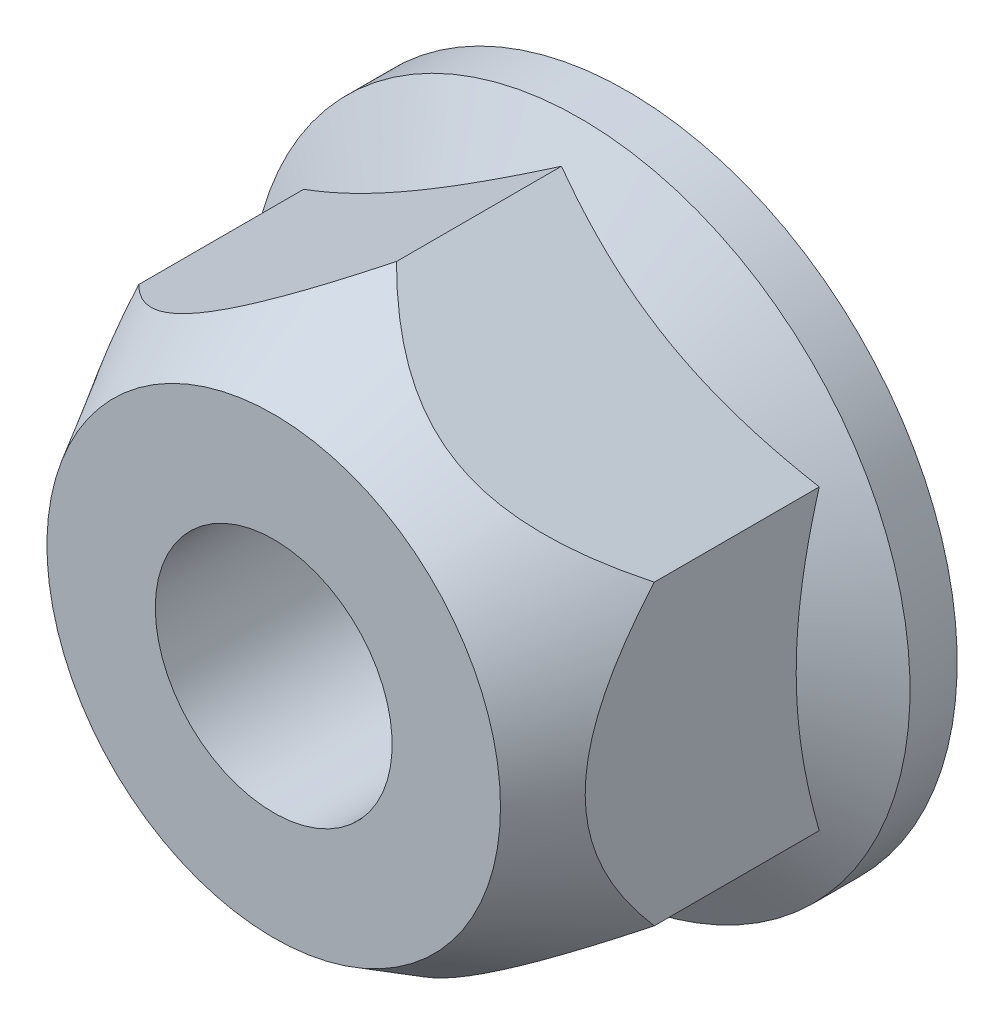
ISO-10303-21;
HEADER;
FILE_DESCRIPTION(('STEP AP214'),'2;1');
FILE_NAME('part.step','',(''),(''),'','','');
FILE_SCHEMA(('AUTOMOTIVE_DESIGN { 1 0 10303 214 1 1 1 1 }'));
ENDSEC;
DATA;
#1=APPLICATION_CONTEXT('core data for automotive mechanical design processes');
#2=APPLICATION_PROTOCOL_DEFINITION('international standard','automotive_design',2000,#1);
#3=PRODUCT_CONTEXT('',#1,'mechanical');
#4=PRODUCT('Part','Part','',(#3));
#5=PRODUCT_RELATED_PRODUCT_CATEGORY('part','',(#4));
#6=PRODUCT_DEFINITION_FORMATION('','',#4);
#7=PRODUCT_DEFINITION_CONTEXT('part definition',#1,'design');
#8=PRODUCT_DEFINITION('design','',#6,#7);
#9=PRODUCT_DEFINITION_SHAPE('','',#8);
#10=(LENGTH_UNIT() NAMED_UNIT(*) SI_UNIT(.MILLI.,.METRE.));
#11=(NAMED_UNIT(*) PLANE_ANGLE_UNIT() SI_UNIT($,.RADIAN.));
#12=(NAMED_UNIT(*) SI_UNIT($,.STERADIAN.) SOLID_ANGLE_UNIT());
#13=UNCERTAINTY_MEASURE_WITH_UNIT(LENGTH_MEASURE(1.E-05),#10,'distance_accuracy_value','');
#14=(GEOMETRIC_REPRESENTATION_CONTEXT(3) GLOBAL_UNCERTAINTY_ASSIGNED_CONTEXT((#13)) GLOBAL_UNIT_ASSIGNED_CONTEXT((#10,
#11,#12)) REPRESENTATION_CONTEXT('',''));
#15=CARTESIAN_POINT('',(0.,0.,0.));
#16=DIRECTION('',(0.,0.,1.));
#17=DIRECTION('',(1.,0.,0.));
#18=AXIS2_PLACEMENT_3D('',#15,#16,#17);
#19=CARTESIAN_POINT('',(0.,-6.41580486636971,24.5946241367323));
#20=DIRECTION('',(-0.5,0.866025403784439,0.));
#21=DIRECTION('',(-0.866025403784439,-0.5,0.));
#22=AXIS2_PLACEMENT_3D('',#19,#20,#21);
#23=PLANE('',#22);
#24=CARTESIAN_POINT('',(-0.000199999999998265,-6.41592033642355,4.97374844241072));
#25=CARTESIAN_POINT('',(0.0579139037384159,-6.38236825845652,5.03185952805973));
#26=CARTESIAN_POINT('',(0.11660767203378,-6.34848139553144,5.08919556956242));
#27=CARTESIAN_POINT('',(0.235282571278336,-6.27996441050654,5.20210150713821));
#28=CARTESIAN_POINT('',(0.295264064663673,-6.24533407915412,5.25767089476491));
#29=CARTESIAN_POINT('',(0.477899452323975,-6.13988948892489,5.42191134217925));
#30=CARTESIAN_POINT('',(0.602654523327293,-6.06786211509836,5.52751781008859));
#31=CARTESIAN_POINT('',(0.861876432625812,-5.91820027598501,5.73051382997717));
#32=CARTESIAN_POINT('',(0.99651091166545,-5.84046902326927,5.82762059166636));
#33=CARTESIAN_POINT('',(1.27307331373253,-5.68079564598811,6.00635658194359));
#34=CARTESIAN_POINT('',(1.41498420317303,-5.5988633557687,6.08802003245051));
#35=CARTESIAN_POINT('',(1.63990349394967,-5.46900614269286,6.19835812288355));
#36=CARTESIAN_POINT('',(1.72027897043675,-5.42260133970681,6.23421973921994));
#37=CARTESIAN_POINT('',(1.88313504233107,-5.32857634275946,6.29899176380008));
#38=CARTESIAN_POINT('',(1.96561579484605,-5.28095605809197,6.32790165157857));
#39=CARTESIAN_POINT('',(2.13169814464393,-5.18506836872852,6.3776650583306));
#40=CARTESIAN_POINT('',(2.2152856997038,-5.1368090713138,6.39858054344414));
#41=CARTESIAN_POINT('',(2.38371880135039,-5.0395641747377,6.43192134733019));
#42=CARTESIAN_POINT('',(2.46856410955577,-4.99057871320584,6.44434825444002));
#43=CARTESIAN_POINT('',(2.6396754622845,-4.89178752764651,6.46028925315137));
#44=CARTESIAN_POINT('',(2.72594739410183,-4.84197840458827,6.4637201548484));
#45=CARTESIAN_POINT('',(2.89839057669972,-4.74241828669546,6.46128042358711));
#46=CARTESIAN_POINT('',(2.98456182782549,-4.69266729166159,6.45540982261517));
#47=CARTESIAN_POINT('',(3.15626026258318,-4.5935371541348,6.43459655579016));
#48=CARTESIAN_POINT('',(3.24178563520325,-4.54415905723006,6.41963416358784));
#49=CARTESIAN_POINT('',(3.41142663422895,-4.44621678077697,6.38121396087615));
#50=CARTESIAN_POINT('',(3.49554137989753,-4.3976531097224,6.35775103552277));
#51=CARTESIAN_POINT('',(3.68587477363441,-4.28776407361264,6.29527408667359));
#52=CARTESIAN_POINT('',(3.79146933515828,-4.22679902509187,6.25372644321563));
#53=CARTESIAN_POINT('',(3.99901821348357,-4.10697062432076,6.15986281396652));
#54=CARTESIAN_POINT('',(4.10097023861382,-4.04810859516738,6.10754018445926));
#55=CARTESIAN_POINT('',(4.30148211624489,-3.93234300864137,5.99382365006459));
#56=CARTESIAN_POINT('',(4.40002661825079,-3.87544831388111,5.9323939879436));
#57=CARTESIAN_POINT('',(4.59340867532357,-3.76379913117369,5.80230485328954));
#58=CARTESIAN_POINT('',(4.68824683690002,-3.70904429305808,5.73364657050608));
#59=CARTESIAN_POINT('',(4.91790961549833,-3.57644842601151,5.5571180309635));
#60=CARTESIAN_POINT('',(5.05078966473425,-3.49973009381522,5.44587614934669));
#61=CARTESIAN_POINT('',(5.2446221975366,-3.38782082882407,5.27270411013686));
#62=CARTESIAN_POINT('',(5.30797541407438,-3.35124383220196,5.21427636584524));
#63=CARTESIAN_POINT('',(5.43324962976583,-3.27891673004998,5.09543609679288));
#64=CARTESIAN_POINT('',(5.49517092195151,-3.24316645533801,5.03502398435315));
#65=CARTESIAN_POINT('',(5.55645,-3.20778696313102,4.97374844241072));
#66=B_SPLINE_CURVE_WITH_KNOTS('',3,(#24,#25,#26,#27,#28,#29,#30,#31,#32,#33,#34,#35,#36,#37,#38,
#39,#40,#41,#42,#43,#44,#45,#46,#47,#48,#49,#50,#51,#52,#53,#54,#55,#56,#57,#58,#59,#60,#61,#62,
#63,#64,#65),.UNSPECIFIED.,.F.,.F.,(4,2,2,2,2,2,2,2,2,2,2,2,2,2,2,2,2,2,2,2,4),(0.,
0.266293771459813,0.532663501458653,1.06811595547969,1.61740258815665,2.1654573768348,
2.46372298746,2.76201092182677,3.05793747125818,3.35380863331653,3.65240634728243,
3.95100303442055,4.25024990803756,4.54967714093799,4.93548916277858,5.3215397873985,
5.70914841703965,6.09669335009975,6.66470266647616,6.94554888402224,7.22633711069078),.UNSPECIFIED.);
#67=CARTESIAN_POINT('',(0.,-6.41580486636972,4.97394844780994));
#68=VERTEX_POINT('',#67);
#69=CARTESIAN_POINT('',(5.55625,-3.20790243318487,4.97394844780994));
#70=VERTEX_POINT('',#69);
#71=EDGE_CURVE('E106',#68,#70,#66,.T.);
#72=ORIENTED_EDGE('',*,*,#71,.F.);
#73=DIRECTION('',(0.,0.,-1.));
#74=VECTOR('',#73,1.);
#75=CARTESIAN_POINT('',(0.,-6.41580486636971,24.5946241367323));
#76=LINE('',#75,#74);
#77=CARTESIAN_POINT('',(0.,-6.41580486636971,1.41794844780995));
#78=VERTEX_POINT('',#77);
#79=EDGE_CURVE('E121',#68,#78,#76,.T.);
#80=ORIENTED_EDGE('',*,*,#79,.T.);
#81=CARTESIAN_POINT('',(-0.000199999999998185,-6.41592033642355,1.41788177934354));
#82=CARTESIAN_POINT('',(0.121932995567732,-6.34540681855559,1.45858712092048));
#83=CARTESIAN_POINT('',(0.244521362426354,-6.27463039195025,1.49744514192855));
#84=CARTESIAN_POINT('',(0.490693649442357,-6.13250275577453,1.57095774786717));
#85=CARTESIAN_POINT('',(0.614277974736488,-6.06115131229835,1.60561051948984));
#86=CARTESIAN_POINT('',(0.987009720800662,-5.84595453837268,1.70258079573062));
#87=CARTESIAN_POINT('',(1.2376284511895,-5.70125974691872,1.75773662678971));
#88=CARTESIAN_POINT('',(1.61267482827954,-5.48472662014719,1.82241377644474));
#89=CARTESIAN_POINT('',(1.73598185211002,-5.41353527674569,1.84083851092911));
#90=CARTESIAN_POINT('',(1.98315307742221,-5.27083090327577,1.87173431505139));
#91=CARTESIAN_POINT('',(2.10701722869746,-5.19931790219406,1.88420591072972));
#92=CARTESIAN_POINT('',(2.35496067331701,-5.05616768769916,1.90287759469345));
#93=CARTESIAN_POINT('',(2.47903956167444,-4.98453070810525,1.90908480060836));
#94=CARTESIAN_POINT('',(2.72730512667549,-4.84119451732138,1.91510126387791));
#95=CARTESIAN_POINT('',(2.85149179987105,-4.76949530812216,1.91491071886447));
#96=CARTESIAN_POINT('',(3.1917275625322,-4.5730600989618,1.90559443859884));
#97=CARTESIAN_POINT('',(3.40766529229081,-4.44838839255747,1.88995302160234));
#98=CARTESIAN_POINT('',(3.83810650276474,-4.19987304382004,1.84035277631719));
#99=CARTESIAN_POINT('',(4.05260846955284,-4.07603027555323,1.80637699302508));
#100=CARTESIAN_POINT('',(4.48391602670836,-3.82701474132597,1.72144693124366));
#101=CARTESIAN_POINT('',(4.7006671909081,-3.70187339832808,1.67013279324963));
#102=CARTESIAN_POINT('',(5.13093704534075,-3.45345698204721,1.55367022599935));
#103=CARTESIAN_POINT('',(5.34446124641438,-3.33017872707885,1.48854915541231));
#104=CARTESIAN_POINT('',(5.55645,-3.20778696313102,1.41788177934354));
#105=B_SPLINE_CURVE_WITH_KNOTS('',3,(#81,#82,#83,#84,#85,#86,#87,#88,#89,#90,#91,#92,#93,#94,
#95,#96,#97,#98,#99,#100,#101,#102,#103,#104),.UNSPECIFIED.,.F.,.F.,(4,2,2,2,2,2,2,2,2,2,2,4),
(0.,0.44031690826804,0.880823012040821,1.76366572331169,2.19427472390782,2.62484566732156,
3.05492684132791,3.48499472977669,4.23370964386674,4.98311813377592,5.74914806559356,
6.51367405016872),.UNSPECIFIED.);
#106=CARTESIAN_POINT('',(5.55625,-3.20790243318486,1.41794844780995));
#107=VERTEX_POINT('',#106);
#108=EDGE_CURVE('E211',#78,#107,#105,.T.);
#109=ORIENTED_EDGE('',*,*,#108,.T.);
#110=DIRECTION('',(0.,0.,-1.));
#111=VECTOR('',#110,1.);
#112=CARTESIAN_POINT('',(5.55625,-3.20790243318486,24.5946241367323));
#113=LINE('',#112,#111);
#114=EDGE_CURVE('E73',#70,#107,#113,.T.);
#115=ORIENTED_EDGE('',*,*,#114,.F.);
#116=EDGE_LOOP('',(#72,#80,#109,#115));
#117=FACE_BOUND('',#116,.T.);
#118=ADVANCED_FACE('F43',(#117),#23,.F.);
#119=CARTESIAN_POINT('',(5.55625,-3.20790243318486,24.5946241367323));
#120=DIRECTION('',(-1.,0.,0.));
#121=DIRECTION('',(0.,-1.,0.));
#122=AXIS2_PLACEMENT_3D('',#119,#120,#121);
#123=PLANE('',#122);
#124=CARTESIAN_POINT('',(5.55625,-5.72144322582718,2.27266982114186));
#125=CARTESIAN_POINT('',(5.55625,-5.60257398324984,2.42033855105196));
#126=CARTESIAN_POINT('',(5.55625,-5.48263800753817,2.56716146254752));
#127=CARTESIAN_POINT('',(5.55625,-5.2402111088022,2.85874592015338));
#128=CARTESIAN_POINT('',(5.55625,-5.11771952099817,3.00350691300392));
#129=CARTESIAN_POINT('',(5.55625,-4.86865624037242,3.29186943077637));
#130=CARTESIAN_POINT('',(5.55625,-4.74205700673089,3.43544724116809));
#131=CARTESIAN_POINT('',(5.55625,-4.48538905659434,3.71945110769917));
#132=CARTESIAN_POINT('',(5.55625,-4.35532067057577,3.8598774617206));
#133=CARTESIAN_POINT('',(5.55625,-4.08219747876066,4.14614227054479));
#134=CARTESIAN_POINT('',(5.55625,-3.9388574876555,4.29170987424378));
#135=CARTESIAN_POINT('',(5.55625,-3.64652690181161,4.57717153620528));
#136=CARTESIAN_POINT('',(5.55625,-3.49753483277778,4.71706409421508));
#137=CARTESIAN_POINT('',(5.55625,-3.19338347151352,4.98878734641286));
#138=CARTESIAN_POINT('',(5.55625,-3.03825074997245,5.12064759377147));
#139=CARTESIAN_POINT('',(5.55625,-2.71999101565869,5.37426476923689));
#140=CARTESIAN_POINT('',(5.55625,-2.55686968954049,5.4960287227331));
#141=CARTESIAN_POINT('',(5.55625,-2.28053896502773,5.68507227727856));
#142=CARTESIAN_POINT('',(5.55625,-2.17009435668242,5.75638428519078));
#143=CARTESIAN_POINT('',(5.55625,-1.94482261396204,5.89187878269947));
#144=CARTESIAN_POINT('',(5.55625,-1.82999401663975,5.95605886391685));
#145=CARTESIAN_POINT('',(5.55625,-1.59692509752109,6.07498387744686));
#146=CARTESIAN_POINT('',(5.55625,-1.47872909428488,6.12981490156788));
#147=CARTESIAN_POINT('',(5.55625,-1.23795588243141,6.2288421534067));
#148=CARTESIAN_POINT('',(5.55625,-1.11538083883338,6.27304355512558));
#149=CARTESIAN_POINT('',(5.55625,-0.900499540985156,6.3383882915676));
#150=CARTESIAN_POINT('',(5.55625,-0.809103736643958,6.36253101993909));
#151=CARTESIAN_POINT('',(5.55625,-0.624676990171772,6.40340448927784));
#152=CARTESIAN_POINT('',(5.55625,-0.531646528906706,6.4201373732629));
#153=CARTESIAN_POINT('',(5.55625,-0.344515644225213,6.44561190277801));
#154=CARTESIAN_POINT('',(5.55625,-0.250415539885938,6.45435587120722));
#155=CARTESIAN_POINT('',(5.55625,-0.0618055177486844,6.46353090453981));
#156=CARTESIAN_POINT('',(5.55625,0.0327044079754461,6.46396180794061));
#157=CARTESIAN_POINT('',(5.55625,0.221385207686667,6.45648970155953));
#158=CARTESIAN_POINT('',(5.55625,0.315556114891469,6.44858753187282));
#159=CARTESIAN_POINT('',(5.55625,0.502890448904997,6.42476188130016));
#160=CARTESIAN_POINT('',(5.55625,0.596053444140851,6.40883509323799));
#161=CARTESIAN_POINT('',(5.55625,0.873190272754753,6.34978562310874));
#162=CARTESIAN_POINT('',(5.55625,1.05483672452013,6.29539262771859));
#163=CARTESIAN_POINT('',(5.55625,1.3705725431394,6.17707631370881));
#164=CARTESIAN_POINT('',(5.55625,1.50646996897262,6.11773793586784));
#165=CARTESIAN_POINT('',(5.55625,1.77257224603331,5.98729105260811));
#166=CARTESIAN_POINT('',(5.55625,1.90277320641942,5.91617465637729));
#167=CARTESIAN_POINT('',(5.55625,2.15901715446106,5.76386043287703));
#168=CARTESIAN_POINT('',(5.55625,2.28499860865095,5.68256026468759));
#169=CARTESIAN_POINT('',(5.55625,2.47006557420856,5.55507455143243));
#170=CARTESIAN_POINT('',(5.55625,2.53109262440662,5.51166538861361));
#171=CARTESIAN_POINT('',(5.55625,2.65193455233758,5.4231929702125));
#172=CARTESIAN_POINT('',(5.55625,2.7117494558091,5.37812974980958));
#173=CARTESIAN_POINT('',(5.55625,2.89799310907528,5.23416606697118));
#174=CARTESIAN_POINT('',(5.55625,3.02238528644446,5.13262423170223));
#175=CARTESIAN_POINT('',(5.55625,3.2666605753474,4.92423182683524));
#176=CARTESIAN_POINT('',(5.55625,3.38654238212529,4.81737974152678));
#177=CARTESIAN_POINT('',(5.55625,3.62250539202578,4.59934830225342));
#178=CARTESIAN_POINT('',(5.55625,3.73858282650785,4.48816488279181));
#179=CARTESIAN_POINT('',(5.55625,3.9673548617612,4.26236245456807));
#180=CARTESIAN_POINT('',(5.55625,4.08004911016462,4.14774309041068));
#181=CARTESIAN_POINT('',(5.55625,4.41498569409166,3.7984077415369));
#182=CARTESIAN_POINT('',(5.55625,4.63278809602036,3.55943449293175));
#183=CARTESIAN_POINT('',(5.55625,5.059308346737,3.0738232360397));
#184=CARTESIAN_POINT('',(5.55625,5.26803088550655,2.82718930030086));
#185=CARTESIAN_POINT('',(5.55625,5.65842897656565,2.35265460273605));
#186=CARTESIAN_POINT('',(5.55625,5.84075170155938,2.12528422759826));
#187=CARTESIAN_POINT('',(5.55625,6.20084949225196,1.66692475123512));
#188=CARTESIAN_POINT('',(5.55625,6.37862385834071,1.43593510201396));
#189=CARTESIAN_POINT('',(5.55625,6.72825503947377,0.974001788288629));
#190=CARTESIAN_POINT('',(5.55625,6.9001578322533,0.743092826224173));
#191=CARTESIAN_POINT('',(5.55625,7.24084911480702,0.279086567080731));
#192=CARTESIAN_POINT('',(5.55625,7.40963846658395,0.0459899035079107));
#193=CARTESIAN_POINT('',(5.55625,7.5771880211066,-0.187981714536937));
#194=B_SPLINE_CURVE_WITH_KNOTS('',3,(#124,#125,#126,#127,#128,#129,#130,#131,#132,#133,#134,
#135,#136,#137,#138,#139,#140,#141,#142,#143,#144,#145,#146,#147,#148,#149,#150,#151,#152,#153,
#154,#155,#156,#157,#158,#159,#160,#161,#162,#163,#164,#165,#166,#167,#168,#169,#170,#171,#172,
#173,#174,#175,#176,#177,#178,#179,#180,#181,#182,#183,#184,#185,#186,#187,#188,#189,#190,#191,
#192,#193),.UNSPECIFIED.,.F.,.F.,(4,2,2,2,2,2,2,2,2,2,2,2,2,2,2,2,2,2,2,2,2,2,2,2,2,2,2,2,2,2,2,
2,2,2,4),(0.,0.568713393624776,1.13757661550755,1.71179073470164,2.2859503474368,
2.89871059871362,3.51163179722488,4.12214151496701,4.73222278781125,5.12641066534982,
5.52073125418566,5.91119756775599,6.301473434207,6.58479622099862,6.86803701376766,
7.15119542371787,7.43435933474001,7.71749470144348,8.00074685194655,8.5671776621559,
9.0114544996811,9.45603019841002,9.90549885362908,10.1301490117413,10.3547943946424,
10.8363089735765,11.3179617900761,11.8000781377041,12.2822445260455,13.251905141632,
14.2210588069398,15.0953151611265,15.96970519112,16.8332904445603,17.6966328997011),.UNSPECIFIED.);
#195=CARTESIAN_POINT('',(5.55625,3.20790243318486,4.97394844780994));
#196=VERTEX_POINT('',#195);
#197=EDGE_CURVE('E99',#70,#196,#194,.T.);
#198=ORIENTED_EDGE('',*,*,#197,.F.);
#199=ORIENTED_EDGE('',*,*,#114,.T.);
#200=CARTESIAN_POINT('',(5.55625,-8.56370768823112,-0.771638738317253));
#201=CARTESIAN_POINT('',(5.55625,-8.3214728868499,-0.654347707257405));
#202=CARTESIAN_POINT('',(5.55625,-8.07867627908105,-0.53819678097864));
#203=CARTESIAN_POINT('',(5.55625,-7.59166048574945,-0.308817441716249));
#204=CARTESIAN_POINT('',(5.55625,-7.34744107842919,-0.195589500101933));
#205=CARTESIAN_POINT('',(5.55625,-6.85599671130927,0.0278826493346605));
#206=CARTESIAN_POINT('',(5.55625,-6.60876259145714,0.138106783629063));
#207=CARTESIAN_POINT('',(5.55625,-6.11230926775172,0.353972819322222));
#208=CARTESIAN_POINT('',(5.55625,-5.86309015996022,0.459614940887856));
#209=CARTESIAN_POINT('',(5.55625,-5.35442791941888,0.6683233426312));
#210=CARTESIAN_POINT('',(5.55625,-5.09490886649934,0.771205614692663));
#211=CARTESIAN_POINT('',(5.55625,-4.57281492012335,0.96905417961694));
#212=CARTESIAN_POINT('',(5.55625,-4.31023968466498,1.06401957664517));
#213=CARTESIAN_POINT('',(5.55625,-3.78212465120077,1.24350233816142));
#214=CARTESIAN_POINT('',(5.55625,-3.51659227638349,1.32804132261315));
#215=CARTESIAN_POINT('',(5.55625,-2.98171924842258,1.48392346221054));
#216=CARTESIAN_POINT('',(5.55625,-2.71237984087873,1.55527083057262));
#217=CARTESIAN_POINT('',(5.55625,-2.17122788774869,1.68093357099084));
#218=CARTESIAN_POINT('',(5.55625,-1.89943676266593,1.73533947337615));
#219=CARTESIAN_POINT('',(5.55625,-1.35253091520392,1.8240085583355));
#220=CARTESIAN_POINT('',(5.55625,-1.07741649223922,1.85827354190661));
#221=CARTESIAN_POINT('',(5.55625,-0.52880869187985,1.90347771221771));
#222=CARTESIAN_POINT('',(5.55625,-0.255340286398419,1.91471251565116));
#223=CARTESIAN_POINT('',(5.55625,0.291572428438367,1.91367874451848));
#224=CARTESIAN_POINT('',(5.55625,0.565016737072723,1.90140961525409));
#225=CARTESIAN_POINT('',(5.55625,1.03084261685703,1.86134810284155));
#226=CARTESIAN_POINT('',(5.55625,1.22372793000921,1.83909156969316));
#227=CARTESIAN_POINT('',(5.55625,1.6080429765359,1.78429826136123));
#228=CARTESIAN_POINT('',(5.55625,1.7994725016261,1.75176004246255));
#229=CARTESIAN_POINT('',(5.55625,2.37134756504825,1.64043774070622));
#230=CARTESIAN_POINT('',(5.55625,2.74915631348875,1.54796772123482));
#231=CARTESIAN_POINT('',(5.55625,3.31400044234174,1.38818156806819));
#232=CARTESIAN_POINT('',(5.55625,3.5039779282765,1.33067819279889));
#233=CARTESIAN_POINT('',(5.55625,3.88208651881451,1.20983855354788));
#234=CARTESIAN_POINT('',(5.55625,4.07021761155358,1.14650225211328));
#235=CARTESIAN_POINT('',(5.55625,4.44469564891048,1.01500145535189));
#236=CARTESIAN_POINT('',(5.55625,4.63104319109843,0.946838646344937));
#237=CARTESIAN_POINT('',(5.55625,5.00220395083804,0.806472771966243));
#238=CARTESIAN_POINT('',(5.55625,5.18701718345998,0.734269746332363));
#239=CARTESIAN_POINT('',(5.55625,5.61077877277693,0.564226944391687));
#240=CARTESIAN_POINT('',(5.55625,5.84925721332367,0.465218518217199));
#241=CARTESIAN_POINT('',(5.55625,6.32428340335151,0.262661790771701));
#242=CARTESIAN_POINT('',(5.55625,6.56083105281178,0.159113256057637));
#243=CARTESIAN_POINT('',(5.55625,7.032335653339,-0.0516451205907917));
#244=CARTESIAN_POINT('',(5.55625,7.26729231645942,-0.15885560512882));
#245=CARTESIAN_POINT('',(5.55625,7.73583378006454,-0.376237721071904));
#246=CARTESIAN_POINT('',(5.55625,7.96941855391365,-0.48640940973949));
#247=CARTESIAN_POINT('',(5.55625,8.66886363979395,-0.820732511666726));
#248=CARTESIAN_POINT('',(5.55625,9.13299392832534,-1.04850140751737));
#249=CARTESIAN_POINT('',(5.55625,10.057949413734,-1.51065284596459));
#250=CARTESIAN_POINT('',(5.55625,10.5187744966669,-1.74503561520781));
#251=CARTESIAN_POINT('',(5.55625,11.1898981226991,-2.09075989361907));
#252=CARTESIAN_POINT('',(5.55625,11.4011640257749,-2.20022904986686));
#253=CARTESIAN_POINT('',(5.55625,11.8232347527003,-2.42004379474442));
#254=CARTESIAN_POINT('',(5.55625,12.0340395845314,-2.53038936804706));
#255=CARTESIAN_POINT('',(5.55625,12.6658701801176,-2.86257508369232));
#256=CARTESIAN_POINT('',(5.55625,13.0862962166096,-3.08555604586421));
#257=CARTESIAN_POINT('',(5.55625,13.9249423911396,-3.53333589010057));
#258=CARTESIAN_POINT('',(5.55625,14.3431653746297,-3.75812945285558));
#259=CARTESIAN_POINT('',(5.55625,15.1785900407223,-4.20955673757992));
#260=CARTESIAN_POINT('',(5.55625,15.5957917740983,-4.43619036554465));
#261=CARTESIAN_POINT('',(5.55625,16.0126138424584,-4.66351578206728));
#262=B_SPLINE_CURVE_WITH_KNOTS('',3,(#200,#201,#202,#203,#204,#205,#206,#207,#208,#209,#210,
#211,#212,#213,#214,#215,#216,#217,#218,#219,#220,#221,#222,#223,#224,#225,#226,#227,#228,#229,
#230,#231,#232,#233,#234,#235,#236,#237,#238,#239,#240,#241,#242,#243,#244,#245,#246,#247,#248,
#249,#250,#251,#252,#253,#254,#255,#256,#257,#258,#259,#260,#261),.UNSPECIFIED.,.F.,.F.,(4,2,2,
2,2,2,2,2,2,2,2,2,2,2,2,2,2,2,2,2,2,2,2,2,2,2,2,2,2,2,4),(0.,0.807422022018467,1.61497344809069,
2.42701175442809,3.23901099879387,4.07641589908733,4.91391542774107,5.74964804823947,
6.58511328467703,7.41603422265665,8.24688084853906,9.06699415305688,9.88712681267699,
10.4693386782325,11.0516323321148,12.2168895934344,12.812309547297,13.4077333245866,
14.0029500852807,14.5981609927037,15.3727419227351,16.1473627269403,16.9221201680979,
17.696892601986,19.2478229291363,20.7988064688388,21.5126332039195,22.2264474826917,
23.6541294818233,25.0785486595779,26.5028955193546),.UNSPECIFIED.);
#263=CARTESIAN_POINT('',(5.55625,3.20790243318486,1.41794844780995));
#264=VERTEX_POINT('',#263);
#265=EDGE_CURVE('E118',#107,#264,#262,.T.);
#266=ORIENTED_EDGE('',*,*,#265,.T.);
#267=DIRECTION('',(0.,0.,-1.));
#268=VECTOR('',#267,1.);
#269=CARTESIAN_POINT('',(5.55625,3.20790243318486,24.5946241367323));
#270=LINE('',#269,#268);
#271=EDGE_CURVE('E113',#196,#264,#270,.T.);
#272=ORIENTED_EDGE('',*,*,#271,.F.);
#273=EDGE_LOOP('',(#198,#199,#266,#272));
#274=FACE_BOUND('',#273,.T.);
#275=ADVANCED_FACE('F120',(#274),#123,.F.);
#276=CARTESIAN_POINT('',(5.55625,3.20790243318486,24.5946241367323));
#277=DIRECTION('',(-0.5,-0.866025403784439,0.));
#278=DIRECTION('',(0.866025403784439,-0.5,0.));
#279=AXIS2_PLACEMENT_3D('',#276,#277,#278);
#280=PLANE('',#279);
#281=CARTESIAN_POINT('',(5.55645,3.20778696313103,4.97374844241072));
#282=CARTESIAN_POINT('',(5.49833609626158,3.24133904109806,5.03185952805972));
#283=CARTESIAN_POINT('',(5.43964232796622,3.27522590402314,5.08919556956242));
#284=CARTESIAN_POINT('',(5.32096742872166,3.34374288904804,5.20210150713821));
#285=CARTESIAN_POINT('',(5.26098593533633,3.37837322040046,5.25767089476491));
#286=CARTESIAN_POINT('',(5.07835054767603,3.48381781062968,5.42191134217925));
#287=CARTESIAN_POINT('',(4.95359547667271,3.55584518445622,5.52751781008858));
#288=CARTESIAN_POINT('',(4.69437356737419,3.70550702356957,5.73051382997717));
#289=CARTESIAN_POINT('',(4.55973908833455,3.78323827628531,5.82762059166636));
#290=CARTESIAN_POINT('',(4.28317668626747,3.94291165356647,6.00635658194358));
#291=CARTESIAN_POINT('',(4.14126579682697,4.02484394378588,6.08802003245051));
#292=CARTESIAN_POINT('',(3.91634650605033,4.15470115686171,6.19835812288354));
#293=CARTESIAN_POINT('',(3.83597102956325,4.20110595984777,6.23421973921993));
#294=CARTESIAN_POINT('',(3.67311495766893,4.29513095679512,6.29899176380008));
#295=CARTESIAN_POINT('',(3.59063420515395,4.34275124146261,6.32790165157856));
#296=CARTESIAN_POINT('',(3.42455185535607,4.43863893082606,6.3776650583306));
#297=CARTESIAN_POINT('',(3.3409643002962,4.48689822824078,6.39858054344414));
#298=CARTESIAN_POINT('',(3.17253119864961,4.58414312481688,6.43192134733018));
#299=CARTESIAN_POINT('',(3.08768589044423,4.63312858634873,6.44434825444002));
#300=CARTESIAN_POINT('',(2.9165745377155,4.73191977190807,6.46028925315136));
#301=CARTESIAN_POINT('',(2.83030260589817,4.78172889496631,6.4637201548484));
#302=CARTESIAN_POINT('',(2.65785942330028,4.88128901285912,6.46128042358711));
#303=CARTESIAN_POINT('',(2.57168817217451,4.93104000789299,6.45540982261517));
#304=CARTESIAN_POINT('',(2.39998973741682,5.03017014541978,6.43459655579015));
#305=CARTESIAN_POINT('',(2.31446436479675,5.07954824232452,6.41963416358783));
#306=CARTESIAN_POINT('',(2.14482336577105,5.17749051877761,6.38121396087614));
#307=CARTESIAN_POINT('',(2.06070862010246,5.22605418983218,6.35775103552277));
#308=CARTESIAN_POINT('',(1.87037522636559,5.33594322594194,6.29527408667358));
#309=CARTESIAN_POINT('',(1.76478066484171,5.39690827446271,6.25372644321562));
#310=CARTESIAN_POINT('',(1.55723178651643,5.51673667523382,6.15986281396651));
#311=CARTESIAN_POINT('',(1.45527976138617,5.5755987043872,6.10754018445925));
#312=CARTESIAN_POINT('',(1.2547678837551,5.69136429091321,5.99382365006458));
#313=CARTESIAN_POINT('',(1.15622338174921,5.74825898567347,5.93239398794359));
#314=CARTESIAN_POINT('',(0.962841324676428,5.85990816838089,5.80230485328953));
#315=CARTESIAN_POINT('',(0.868003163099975,5.9146630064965,5.73364657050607));
#316=CARTESIAN_POINT('',(0.638340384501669,6.04725887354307,5.55711803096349));
#317=CARTESIAN_POINT('',(0.505460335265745,6.12397720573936,5.44587614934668));
#318=CARTESIAN_POINT('',(0.311627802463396,6.23588647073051,5.27270411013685));
#319=CARTESIAN_POINT('',(0.248274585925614,6.27246346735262,5.21427636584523));
#320=CARTESIAN_POINT('',(0.123000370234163,6.3447905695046,5.09543609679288));
#321=CARTESIAN_POINT('',(0.0610790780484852,6.38054084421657,5.03502398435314));
#322=CARTESIAN_POINT('',(-0.000200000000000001,6.41592033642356,4.97374844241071));
#323=B_SPLINE_CURVE_WITH_KNOTS('',3,(#281,#282,#283,#284,#285,#286,#287,#288,#289,#290,#291,
#292,#293,#294,#295,#296,#297,#298,#299,#300,#301,#302,#303,#304,#305,#306,#307,#308,#309,#310,
#311,#312,#313,#314,#315,#316,#317,#318,#319,#320,#321,#322),.UNSPECIFIED.,.F.,.F.,(4,2,2,2,2,2,
2,2,2,2,2,2,2,2,2,2,2,2,2,2,4),(0.,0.266293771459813,0.532663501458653,1.0681159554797,
1.61740258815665,2.16545737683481,2.46372298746,2.76201092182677,3.05793747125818,
3.35380863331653,3.65240634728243,3.95100303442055,4.25024990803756,4.54967714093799,
4.93548916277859,5.32153978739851,5.70914841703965,6.09669335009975,6.66470266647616,
6.94554888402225,7.22633711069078),.UNSPECIFIED.);
#324=CARTESIAN_POINT('',(0.,6.41580486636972,4.97394844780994));
#325=VERTEX_POINT('',#324);
#326=EDGE_CURVE('E101',#196,#325,#323,.T.);
#327=ORIENTED_EDGE('',*,*,#326,.F.);
#328=ORIENTED_EDGE('',*,*,#271,.T.);
#329=CARTESIAN_POINT('',(5.55645,3.20778696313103,1.41788177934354));
#330=CARTESIAN_POINT('',(5.43431700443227,3.27830048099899,1.45858712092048));
#331=CARTESIAN_POINT('',(5.31172863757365,3.34907690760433,1.49744514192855));
#332=CARTESIAN_POINT('',(5.06555635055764,3.49120454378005,1.57095774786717));
#333=CARTESIAN_POINT('',(4.94197202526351,3.56255598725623,1.60561051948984));
#334=CARTESIAN_POINT('',(4.56924027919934,3.7777527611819,1.70258079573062));
#335=CARTESIAN_POINT('',(4.3186215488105,3.92244755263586,1.75773662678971));
#336=CARTESIAN_POINT('',(3.94357517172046,4.13898067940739,1.82241377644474));
#337=CARTESIAN_POINT('',(3.82026814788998,4.21017202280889,1.84083851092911));
#338=CARTESIAN_POINT('',(3.57309692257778,4.35287639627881,1.87173431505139));
#339=CARTESIAN_POINT('',(3.44923277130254,4.42438939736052,1.88420591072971));
#340=CARTESIAN_POINT('',(3.20128932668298,4.56753961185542,1.90287759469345));
#341=CARTESIAN_POINT('',(3.07721043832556,4.63917659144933,1.90908480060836));
#342=CARTESIAN_POINT('',(2.82894487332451,4.7825127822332,1.91510126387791));
#343=CARTESIAN_POINT('',(2.70475820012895,4.85421199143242,1.91491071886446));
#344=CARTESIAN_POINT('',(2.36452243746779,5.05064720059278,1.90559443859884));
#345=CARTESIAN_POINT('',(2.14858470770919,5.1753189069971,1.88995302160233));
#346=CARTESIAN_POINT('',(1.71814349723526,5.42383425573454,1.84035277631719));
#347=CARTESIAN_POINT('',(1.50364153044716,5.54767702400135,1.80637699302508));
#348=CARTESIAN_POINT('',(1.07233397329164,5.79669255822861,1.72144693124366));
#349=CARTESIAN_POINT('',(0.855582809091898,5.9218339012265,1.67013279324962));
#350=CARTESIAN_POINT('',(0.425312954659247,6.17025031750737,1.55367022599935));
#351=CARTESIAN_POINT('',(0.211788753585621,6.29352857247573,1.48854915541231));
#352=CARTESIAN_POINT('',(-0.000200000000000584,6.41592033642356,1.41788177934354));
#353=B_SPLINE_CURVE_WITH_KNOTS('',3,(#329,#330,#331,#332,#333,#334,#335,#336,#337,#338,#339,
#340,#341,#342,#343,#344,#345,#346,#347,#348,#349,#350,#351,#352),.UNSPECIFIED.,.F.,.F.,(4,2,2,
2,2,2,2,2,2,2,2,4),(0.,0.44031690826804,0.880823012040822,1.76366572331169,2.19427472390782,
2.62484566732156,3.05492684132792,3.48499472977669,4.23370964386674,4.98311813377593,
5.74914806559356,6.51367405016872),.UNSPECIFIED.);
#354=CARTESIAN_POINT('',(0.,6.41580486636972,1.41794844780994));
#355=VERTEX_POINT('',#354);
#356=EDGE_CURVE('E194',#264,#355,#353,.T.);
#357=ORIENTED_EDGE('',*,*,#356,.T.);
#358=DIRECTION('',(0.,0.,-1.));
#359=VECTOR('',#358,1.);
#360=CARTESIAN_POINT('',(0.,6.41580486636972,24.5946241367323));
#361=LINE('',#360,#359);
#362=EDGE_CURVE('E112',#325,#355,#361,.T.);
#363=ORIENTED_EDGE('',*,*,#362,.F.);
#364=EDGE_LOOP('',(#327,#328,#357,#363));
#365=FACE_BOUND('',#364,.T.);
#366=ADVANCED_FACE('F111',(#365),#280,.F.);
#367=CARTESIAN_POINT('',(0.,6.41580486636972,24.5946241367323));
#368=DIRECTION('',(0.5,-0.866025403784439,0.));
#369=DIRECTION('',(0.866025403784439,0.5,0.));
#370=AXIS2_PLACEMENT_3D('',#367,#368,#369);
#371=PLANE('',#370);
#372=CARTESIAN_POINT('',(0.000199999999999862,6.41592033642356,4.97374844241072));
#373=CARTESIAN_POINT('',(-0.0579139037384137,6.38236825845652,5.03185952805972));
#374=CARTESIAN_POINT('',(-0.116607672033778,6.34848139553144,5.08919556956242));
#375=CARTESIAN_POINT('',(-0.235282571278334,6.27996441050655,5.20210150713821));
#376=CARTESIAN_POINT('',(-0.295264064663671,6.24533407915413,5.25767089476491));
#377=CARTESIAN_POINT('',(-0.477899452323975,6.1398894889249,5.42191134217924));
#378=CARTESIAN_POINT('',(-0.602654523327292,6.06786211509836,5.52751781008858));
#379=CARTESIAN_POINT('',(-0.861876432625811,5.91820027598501,5.73051382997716));
#380=CARTESIAN_POINT('',(-0.996510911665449,5.84046902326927,5.82762059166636));
#381=CARTESIAN_POINT('',(-1.27307331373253,5.68079564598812,6.00635658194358));
#382=CARTESIAN_POINT('',(-1.41498420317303,5.5988633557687,6.08802003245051));
#383=CARTESIAN_POINT('',(-1.63990349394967,5.46900614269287,6.19835812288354));
#384=CARTESIAN_POINT('',(-1.72027897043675,5.42260133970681,6.23421973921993));
#385=CARTESIAN_POINT('',(-1.88313504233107,5.32857634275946,6.29899176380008));
#386=CARTESIAN_POINT('',(-1.96561579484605,5.28095605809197,6.32790165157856));
#387=CARTESIAN_POINT('',(-2.13169814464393,5.18506836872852,6.3776650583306));
#388=CARTESIAN_POINT('',(-2.2152856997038,5.1368090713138,6.39858054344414));
#389=CARTESIAN_POINT('',(-2.38371880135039,5.0395641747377,6.43192134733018));
#390=CARTESIAN_POINT('',(-2.46856410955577,4.99057871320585,6.44434825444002));
#391=CARTESIAN_POINT('',(-2.6396754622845,4.89178752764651,6.46028925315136));
#392=CARTESIAN_POINT('',(-2.72594739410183,4.84197840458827,6.4637201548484));
#393=CARTESIAN_POINT('',(-2.89839057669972,4.74241828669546,6.46128042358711));
#394=CARTESIAN_POINT('',(-2.98456182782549,4.69266729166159,6.45540982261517));
#395=CARTESIAN_POINT('',(-3.15626026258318,4.5935371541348,6.43459655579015));
#396=CARTESIAN_POINT('',(-3.24178563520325,4.54415905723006,6.41963416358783));
#397=CARTESIAN_POINT('',(-3.41142663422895,4.44621678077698,6.38121396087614));
#398=CARTESIAN_POINT('',(-3.49554137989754,4.3976531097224,6.35775103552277));
#399=CARTESIAN_POINT('',(-3.68587477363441,4.28776407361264,6.29527408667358));
#400=CARTESIAN_POINT('',(-3.79146933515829,4.22679902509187,6.25372644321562));
#401=CARTESIAN_POINT('',(-3.99901821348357,4.10697062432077,6.15986281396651));
#402=CARTESIAN_POINT('',(-4.10097023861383,4.04810859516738,6.10754018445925));
#403=CARTESIAN_POINT('',(-4.30148211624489,3.93234300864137,5.99382365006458));
#404=CARTESIAN_POINT('',(-4.40002661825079,3.87544831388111,5.93239398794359));
#405=CARTESIAN_POINT('',(-4.59340867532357,3.7637991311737,5.80230485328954));
#406=CARTESIAN_POINT('',(-4.68824683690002,3.70904429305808,5.73364657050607));
#407=CARTESIAN_POINT('',(-4.91790961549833,3.57644842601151,5.55711803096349));
#408=CARTESIAN_POINT('',(-5.05078966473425,3.49973009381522,5.44587614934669));
#409=CARTESIAN_POINT('',(-5.2446221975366,3.38782082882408,5.27270411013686));
#410=CARTESIAN_POINT('',(-5.30797541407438,3.35124383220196,5.21427636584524));
#411=CARTESIAN_POINT('',(-5.43324962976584,3.27891673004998,5.09543609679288));
#412=CARTESIAN_POINT('',(-5.49517092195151,3.24316645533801,5.03502398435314));
#413=CARTESIAN_POINT('',(-5.55645,3.20778696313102,4.97374844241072));
#414=B_SPLINE_CURVE_WITH_KNOTS('',3,(#372,#373,#374,#375,#376,#377,#378,#379,#380,#381,#382,
#383,#384,#385,#386,#387,#388,#389,#390,#391,#392,#393,#394,#395,#396,#397,#398,#399,#400,#401,
#402,#403,#404,#405,#406,#407,#408,#409,#410,#411,#412,#413),.UNSPECIFIED.,.F.,.F.,(4,2,2,2,2,2,
2,2,2,2,2,2,2,2,2,2,2,2,2,2,4),(0.,0.266293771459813,0.532663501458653,1.06811595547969,
1.61740258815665,2.16545737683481,2.46372298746,2.76201092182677,3.05793747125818,
3.35380863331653,3.65240634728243,3.95100303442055,4.25024990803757,4.54967714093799,
4.93548916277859,5.32153978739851,5.70914841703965,6.09669335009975,6.66470266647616,
6.94554888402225,7.22633711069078),.UNSPECIFIED.);
#415=CARTESIAN_POINT('',(-5.55625,3.20790243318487,4.97394844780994));
#416=VERTEX_POINT('',#415);
#417=EDGE_CURVE('E114',#325,#416,#414,.T.);
#418=ORIENTED_EDGE('',*,*,#417,.F.);
#419=ORIENTED_EDGE('',*,*,#362,.T.);
#420=CARTESIAN_POINT('',(0.000199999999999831,6.41592033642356,1.41788177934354));
#421=CARTESIAN_POINT('',(-0.121932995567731,6.34540681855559,1.45858712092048));
#422=CARTESIAN_POINT('',(-0.244521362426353,6.27463039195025,1.49744514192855));
#423=CARTESIAN_POINT('',(-0.490693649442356,6.13250275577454,1.57095774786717));
#424=CARTESIAN_POINT('',(-0.614277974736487,6.06115131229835,1.60561051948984));
#425=CARTESIAN_POINT('',(-0.987009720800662,5.84595453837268,1.70258079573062));
#426=CARTESIAN_POINT('',(-1.2376284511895,5.70125974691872,1.75773662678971));
#427=CARTESIAN_POINT('',(-1.61267482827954,5.48472662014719,1.82241377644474));
#428=CARTESIAN_POINT('',(-1.73598185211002,5.41353527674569,1.84083851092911));
#429=CARTESIAN_POINT('',(-1.98315307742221,5.27083090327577,1.87173431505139));
#430=CARTESIAN_POINT('',(-2.10701722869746,5.19931790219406,1.88420591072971));
#431=CARTESIAN_POINT('',(-2.35496067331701,5.05616768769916,1.90287759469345));
#432=CARTESIAN_POINT('',(-2.47903956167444,4.98453070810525,1.90908480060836));
#433=CARTESIAN_POINT('',(-2.72730512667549,4.84119451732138,1.91510126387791));
#434=CARTESIAN_POINT('',(-2.85149179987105,4.76949530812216,1.91491071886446));
#435=CARTESIAN_POINT('',(-3.1917275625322,4.5730600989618,1.90559443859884));
#436=CARTESIAN_POINT('',(-3.40766529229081,4.44838839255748,1.88995302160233));
#437=CARTESIAN_POINT('',(-3.83810650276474,4.19987304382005,1.84035277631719));
#438=CARTESIAN_POINT('',(-4.05260846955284,4.07603027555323,1.80637699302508));
#439=CARTESIAN_POINT('',(-4.48391602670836,3.82701474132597,1.72144693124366));
#440=CARTESIAN_POINT('',(-4.7006671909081,3.70187339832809,1.67013279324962));
#441=CARTESIAN_POINT('',(-5.13093704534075,3.45345698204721,1.55367022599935));
#442=CARTESIAN_POINT('',(-5.34446124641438,3.33017872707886,1.48854915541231));
#443=CARTESIAN_POINT('',(-5.55645,3.20778696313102,1.41788177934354));
#444=B_SPLINE_CURVE_WITH_KNOTS('',3,(#420,#421,#422,#423,#424,#425,#426,#427,#428,#429,#430,
#431,#432,#433,#434,#435,#436,#437,#438,#439,#440,#441,#442,#443),.UNSPECIFIED.,.F.,.F.,(4,2,2,
2,2,2,2,2,2,2,2,4),(0.,0.440316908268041,0.880823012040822,1.76366572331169,2.19427472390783,
2.62484566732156,3.05492684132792,3.48499472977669,4.23370964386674,4.98311813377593,
5.74914806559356,6.51367405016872),.UNSPECIFIED.);
#445=CARTESIAN_POINT('',(-5.55625,3.20790243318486,1.41794844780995));
#446=VERTEX_POINT('',#445);
#447=EDGE_CURVE('E203',#355,#446,#444,.T.);
#448=ORIENTED_EDGE('',*,*,#447,.T.);
#449=DIRECTION('',(0.,0.,-1.));
#450=VECTOR('',#449,1.);
#451=CARTESIAN_POINT('',(-5.55625,3.20790243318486,24.5946241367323));
#452=LINE('',#451,#450);
#453=EDGE_CURVE('E125',#416,#446,#452,.T.);
#454=ORIENTED_EDGE('',*,*,#453,.F.);
#455=EDGE_LOOP('',(#418,#419,#448,#454));
#456=FACE_BOUND('',#455,.T.);
#457=ADVANCED_FACE('F162',(#456),#371,.F.);
#458=CARTESIAN_POINT('',(-5.55625,3.20790243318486,24.5946241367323));
#459=DIRECTION('',(1.,0.,0.));
#460=DIRECTION('',(0.,0.,-1.));
#461=AXIS2_PLACEMENT_3D('',#458,#459,#460);
#462=PLANE('',#461);
#463=CARTESIAN_POINT('',(-5.55625,-5.72144322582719,2.27266982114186));
#464=CARTESIAN_POINT('',(-5.55625,-5.60257398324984,2.42033855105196));
#465=CARTESIAN_POINT('',(-5.55625,-5.48263800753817,2.56716146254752));
#466=CARTESIAN_POINT('',(-5.55625,-5.2402111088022,2.85874592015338));
#467=CARTESIAN_POINT('',(-5.55625,-5.11771952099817,3.00350691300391));
#468=CARTESIAN_POINT('',(-5.55625,-4.86865624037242,3.29186943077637));
#469=CARTESIAN_POINT('',(-5.55625,-4.74205700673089,3.43544724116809));
#470=CARTESIAN_POINT('',(-5.55625,-4.48538905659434,3.71945110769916));
#471=CARTESIAN_POINT('',(-5.55625,-4.35532067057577,3.8598774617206));
#472=CARTESIAN_POINT('',(-5.55625,-4.08219747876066,4.14614227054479));
#473=CARTESIAN_POINT('',(-5.55625,-3.9388574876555,4.29170987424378));
#474=CARTESIAN_POINT('',(-5.55625,-3.6465269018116,4.57717153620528));
#475=CARTESIAN_POINT('',(-5.55625,-3.49753483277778,4.71706409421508));
#476=CARTESIAN_POINT('',(-5.55625,-3.19338347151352,4.98878734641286));
#477=CARTESIAN_POINT('',(-5.55625,-3.03825074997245,5.12064759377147));
#478=CARTESIAN_POINT('',(-5.55625,-2.71999101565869,5.37426476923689));
#479=CARTESIAN_POINT('',(-5.55625,-2.55686968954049,5.4960287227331));
#480=CARTESIAN_POINT('',(-5.55625,-2.28053896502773,5.68507227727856));
#481=CARTESIAN_POINT('',(-5.55625,-2.17009435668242,5.75638428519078));
#482=CARTESIAN_POINT('',(-5.55625,-1.94482261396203,5.89187878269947));
#483=CARTESIAN_POINT('',(-5.55625,-1.82999401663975,5.95605886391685));
#484=CARTESIAN_POINT('',(-5.55625,-1.59692509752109,6.07498387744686));
#485=CARTESIAN_POINT('',(-5.55625,-1.47872909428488,6.12981490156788));
#486=CARTESIAN_POINT('',(-5.55625,-1.23795588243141,6.2288421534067));
#487=CARTESIAN_POINT('',(-5.55625,-1.11538083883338,6.27304355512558));
#488=CARTESIAN_POINT('',(-5.55625,-0.900499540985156,6.3383882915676));
#489=CARTESIAN_POINT('',(-5.55625,-0.809103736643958,6.36253101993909));
#490=CARTESIAN_POINT('',(-5.55625,-0.624676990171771,6.40340448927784));
#491=CARTESIAN_POINT('',(-5.55625,-0.531646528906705,6.4201373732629));
#492=CARTESIAN_POINT('',(-5.55625,-0.344515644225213,6.44561190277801));
#493=CARTESIAN_POINT('',(-5.55625,-0.250415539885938,6.45435587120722));
#494=CARTESIAN_POINT('',(-5.55625,-0.0618055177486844,6.46353090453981));
#495=CARTESIAN_POINT('',(-5.55625,0.0327044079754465,6.46396180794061));
#496=CARTESIAN_POINT('',(-5.55625,0.221385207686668,6.45648970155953));
#497=CARTESIAN_POINT('',(-5.55625,0.31555611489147,6.44858753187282));
#498=CARTESIAN_POINT('',(-5.55625,0.502890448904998,6.42476188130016));
#499=CARTESIAN_POINT('',(-5.55625,0.596053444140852,6.40883509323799));
#500=CARTESIAN_POINT('',(-5.55625,0.873190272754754,6.34978562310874));
#501=CARTESIAN_POINT('',(-5.55625,1.05483672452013,6.29539262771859));
#502=CARTESIAN_POINT('',(-5.55625,1.3705725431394,6.17707631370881));
#503=CARTESIAN_POINT('',(-5.55625,1.50646996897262,6.11773793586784));
#504=CARTESIAN_POINT('',(-5.55625,1.77257224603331,5.98729105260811));
#505=CARTESIAN_POINT('',(-5.55625,1.90277320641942,5.91617465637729));
#506=CARTESIAN_POINT('',(-5.55625,2.15901715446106,5.76386043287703));
#507=CARTESIAN_POINT('',(-5.55625,2.28499860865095,5.68256026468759));
#508=CARTESIAN_POINT('',(-5.55625,2.47006557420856,5.55507455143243));
#509=CARTESIAN_POINT('',(-5.55625,2.53109262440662,5.51166538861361));
#510=CARTESIAN_POINT('',(-5.55625,2.65193455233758,5.4231929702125));
#511=CARTESIAN_POINT('',(-5.55625,2.7117494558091,5.37812974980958));
#512=CARTESIAN_POINT('',(-5.55625,2.89799310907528,5.23416606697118));
#513=CARTESIAN_POINT('',(-5.55625,3.02238528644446,5.13262423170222));
#514=CARTESIAN_POINT('',(-5.55625,3.2666605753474,4.92423182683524));
#515=CARTESIAN_POINT('',(-5.55625,3.38654238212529,4.81737974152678));
#516=CARTESIAN_POINT('',(-5.55625,3.62250539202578,4.59934830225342));
#517=CARTESIAN_POINT('',(-5.55625,3.73858282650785,4.48816488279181));
#518=CARTESIAN_POINT('',(-5.55625,3.9673548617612,4.26236245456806));
#519=CARTESIAN_POINT('',(-5.55625,4.08004911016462,4.14774309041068));
#520=CARTESIAN_POINT('',(-5.55625,4.41498569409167,3.7984077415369));
#521=CARTESIAN_POINT('',(-5.55625,4.63278809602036,3.55943449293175));
#522=CARTESIAN_POINT('',(-5.55625,5.059308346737,3.0738232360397));
#523=CARTESIAN_POINT('',(-5.55625,5.26803088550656,2.82718930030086));
#524=CARTESIAN_POINT('',(-5.55625,5.65842897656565,2.35265460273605));
#525=CARTESIAN_POINT('',(-5.55625,5.84075170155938,2.12528422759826));
#526=CARTESIAN_POINT('',(-5.55625,6.20084949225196,1.66692475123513));
#527=CARTESIAN_POINT('',(-5.55625,6.37862385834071,1.43593510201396));
#528=CARTESIAN_POINT('',(-5.55625,6.72825503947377,0.974001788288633));
#529=CARTESIAN_POINT('',(-5.55625,6.9001578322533,0.743092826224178));
#530=CARTESIAN_POINT('',(-5.55625,7.24084911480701,0.279086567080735));
#531=CARTESIAN_POINT('',(-5.55625,7.40963846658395,0.0459899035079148));
#532=CARTESIAN_POINT('',(-5.55625,7.5771880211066,-0.187981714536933));
#533=B_SPLINE_CURVE_WITH_KNOTS('',3,(#463,#464,#465,#466,#467,#468,#469,#470,#471,#472,#473,
#474,#475,#476,#477,#478,#479,#480,#481,#482,#483,#484,#485,#486,#487,#488,#489,#490,#491,#492,
#493,#494,#495,#496,#497,#498,#499,#500,#501,#502,#503,#504,#505,#506,#507,#508,#509,#510,#511,
#512,#513,#514,#515,#516,#517,#518,#519,#520,#521,#522,#523,#524,#525,#526,#527,#528,#529,#530,
#531,#532),.UNSPECIFIED.,.F.,.F.,(4,2,2,2,2,2,2,2,2,2,2,2,2,2,2,2,2,2,2,2,2,2,2,2,2,2,2,2,2,2,2,
2,2,2,4),(0.,0.568713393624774,1.13757661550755,1.71179073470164,2.2859503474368,
2.89871059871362,3.51163179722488,4.12214151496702,4.73222278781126,5.12641066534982,
5.52073125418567,5.91119756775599,6.301473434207,6.58479622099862,6.86803701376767,
7.15119542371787,7.43435933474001,7.71749470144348,8.00074685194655,8.5671776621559,
9.0114544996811,9.45603019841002,9.90549885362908,10.1301490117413,10.3547943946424,
10.8363089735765,11.3179617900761,11.8000781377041,12.2822445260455,13.251905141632,
14.2210588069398,15.0953151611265,15.96970519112,16.8332904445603,17.6966328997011),.UNSPECIFIED.);
#534=CARTESIAN_POINT('',(-5.55625,-3.20790243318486,4.97394844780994));
#535=VERTEX_POINT('',#534);
#536=EDGE_CURVE('E62',#416,#535,#533,.F.);
#537=ORIENTED_EDGE('',*,*,#536,.F.);
#538=ORIENTED_EDGE('',*,*,#453,.T.);
#539=CARTESIAN_POINT('',(-5.55625,-8.56370768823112,-0.771638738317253));
#540=CARTESIAN_POINT('',(-5.55625,-8.3214728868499,-0.654347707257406));
#541=CARTESIAN_POINT('',(-5.55625,-8.07867627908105,-0.538196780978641));
#542=CARTESIAN_POINT('',(-5.55625,-7.59166048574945,-0.30881744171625));
#543=CARTESIAN_POINT('',(-5.55625,-7.34744107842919,-0.195589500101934));
#544=CARTESIAN_POINT('',(-5.55625,-6.85599671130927,0.0278826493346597));
#545=CARTESIAN_POINT('',(-5.55625,-6.60876259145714,0.138106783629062));
#546=CARTESIAN_POINT('',(-5.55625,-6.11230926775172,0.353972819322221));
#547=CARTESIAN_POINT('',(-5.55625,-5.86309015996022,0.459614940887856));
#548=CARTESIAN_POINT('',(-5.55625,-5.35442791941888,0.6683233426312));
#549=CARTESIAN_POINT('',(-5.55625,-5.09490886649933,0.771205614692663));
#550=CARTESIAN_POINT('',(-5.55625,-4.57281492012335,0.96905417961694));
#551=CARTESIAN_POINT('',(-5.55625,-4.31023968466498,1.06401957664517));
#552=CARTESIAN_POINT('',(-5.55625,-3.78212465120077,1.24350233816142));
#553=CARTESIAN_POINT('',(-5.55625,-3.51659227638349,1.32804132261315));
#554=CARTESIAN_POINT('',(-5.55625,-2.98171924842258,1.48392346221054));
#555=CARTESIAN_POINT('',(-5.55625,-2.71237984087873,1.55527083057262));
#556=CARTESIAN_POINT('',(-5.55625,-2.17122788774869,1.68093357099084));
#557=CARTESIAN_POINT('',(-5.55625,-1.89943676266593,1.73533947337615));
#558=CARTESIAN_POINT('',(-5.55625,-1.35253091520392,1.8240085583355));
#559=CARTESIAN_POINT('',(-5.55625,-1.07741649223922,1.85827354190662));
#560=CARTESIAN_POINT('',(-5.55625,-0.528808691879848,1.90347771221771));
#561=CARTESIAN_POINT('',(-5.55625,-0.255340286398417,1.91471251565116));
#562=CARTESIAN_POINT('',(-5.55625,0.291572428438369,1.91367874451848));
#563=CARTESIAN_POINT('',(-5.55625,0.565016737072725,1.90140961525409));
#564=CARTESIAN_POINT('',(-5.55625,1.03084261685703,1.86134810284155));
#565=CARTESIAN_POINT('',(-5.55625,1.22372793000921,1.83909156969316));
#566=CARTESIAN_POINT('',(-5.55625,1.6080429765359,1.78429826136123));
#567=CARTESIAN_POINT('',(-5.55625,1.7994725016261,1.75176004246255));
#568=CARTESIAN_POINT('',(-5.55625,2.37134756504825,1.64043774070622));
#569=CARTESIAN_POINT('',(-5.55625,2.74915631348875,1.54796772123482));
#570=CARTESIAN_POINT('',(-5.55625,3.31400044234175,1.38818156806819));
#571=CARTESIAN_POINT('',(-5.55625,3.50397792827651,1.33067819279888));
#572=CARTESIAN_POINT('',(-5.55625,3.88208651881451,1.20983855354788));
#573=CARTESIAN_POINT('',(-5.55625,4.07021761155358,1.14650225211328));
#574=CARTESIAN_POINT('',(-5.55625,4.44469564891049,1.01500145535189));
#575=CARTESIAN_POINT('',(-5.55625,4.63104319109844,0.946838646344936));
#576=CARTESIAN_POINT('',(-5.55625,5.00220395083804,0.806472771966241));
#577=CARTESIAN_POINT('',(-5.55625,5.18701718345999,0.734269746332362));
#578=CARTESIAN_POINT('',(-5.55625,5.61077877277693,0.564226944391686));
#579=CARTESIAN_POINT('',(-5.55625,5.84925721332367,0.465218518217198));
#580=CARTESIAN_POINT('',(-5.55625,6.32428340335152,0.262661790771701));
#581=CARTESIAN_POINT('',(-5.55625,6.56083105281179,0.159113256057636));
#582=CARTESIAN_POINT('',(-5.55625,7.032335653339,-0.0516451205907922));
#583=CARTESIAN_POINT('',(-5.55625,7.26729231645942,-0.158855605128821));
#584=CARTESIAN_POINT('',(-5.55625,7.73583378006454,-0.376237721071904));
#585=CARTESIAN_POINT('',(-5.55625,7.96941855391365,-0.486409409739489));
#586=CARTESIAN_POINT('',(-5.55625,8.66886363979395,-0.820732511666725));
#587=CARTESIAN_POINT('',(-5.55625,9.13299392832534,-1.04850140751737));
#588=CARTESIAN_POINT('',(-5.55625,10.057949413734,-1.51065284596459));
#589=CARTESIAN_POINT('',(-5.55625,10.5187744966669,-1.74503561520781));
#590=CARTESIAN_POINT('',(-5.55625,11.1898981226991,-2.09075989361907));
#591=CARTESIAN_POINT('',(-5.55625,11.4011640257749,-2.20022904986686));
#592=CARTESIAN_POINT('',(-5.55625,11.8232347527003,-2.42004379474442));
#593=CARTESIAN_POINT('',(-5.55625,12.0340395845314,-2.53038936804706));
#594=CARTESIAN_POINT('',(-5.55625,12.6658701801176,-2.86257508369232));
#595=CARTESIAN_POINT('',(-5.55625,13.0862962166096,-3.08555604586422));
#596=CARTESIAN_POINT('',(-5.55625,13.9249423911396,-3.53333589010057));
#597=CARTESIAN_POINT('',(-5.55625,14.3431653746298,-3.75812945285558));
#598=CARTESIAN_POINT('',(-5.55625,15.1785900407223,-4.20955673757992));
#599=CARTESIAN_POINT('',(-5.55625,15.5957917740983,-4.43619036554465));
#600=CARTESIAN_POINT('',(-5.55625,16.0126138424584,-4.66351578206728));
#601=B_SPLINE_CURVE_WITH_KNOTS('',3,(#539,#540,#541,#542,#543,#544,#545,#546,#547,#548,#549,
#550,#551,#552,#553,#554,#555,#556,#557,#558,#559,#560,#561,#562,#563,#564,#565,#566,#567,#568,
#569,#570,#571,#572,#573,#574,#575,#576,#577,#578,#579,#580,#581,#582,#583,#584,#585,#586,#587,
#588,#589,#590,#591,#592,#593,#594,#595,#596,#597,#598,#599,#600),.UNSPECIFIED.,.F.,.F.,(4,2,2,
2,2,2,2,2,2,2,2,2,2,2,2,2,2,2,2,2,2,2,2,2,2,2,2,2,2,2,4),(0.,0.807422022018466,1.61497344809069,
2.42701175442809,3.23901099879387,4.07641589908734,4.91391542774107,5.74964804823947,
6.58511328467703,7.41603422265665,8.24688084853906,9.06699415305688,9.88712681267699,
10.4693386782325,11.0516323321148,12.2168895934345,12.812309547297,13.4077333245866,
14.0029500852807,14.5981609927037,15.3727419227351,16.1473627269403,16.9221201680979,
17.696892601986,19.2478229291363,20.7988064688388,21.5126332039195,22.2264474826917,
23.6541294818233,25.0785486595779,26.5028955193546),.UNSPECIFIED.);
#602=CARTESIAN_POINT('',(-5.55625,-3.20790243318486,1.41794844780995));
#603=VERTEX_POINT('',#602);
#604=EDGE_CURVE('E137',#446,#603,#601,.F.);
#605=ORIENTED_EDGE('',*,*,#604,.T.);
#606=DIRECTION('',(0.,0.,-1.));
#607=VECTOR('',#606,1.);
#608=CARTESIAN_POINT('',(-5.55625,-3.20790243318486,24.5946241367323));
#609=LINE('',#608,#607);
#610=EDGE_CURVE('E128',#535,#603,#609,.T.);
#611=ORIENTED_EDGE('',*,*,#610,.F.);
#612=EDGE_LOOP('',(#537,#538,#605,#611));
#613=FACE_BOUND('',#612,.T.);
#614=ADVANCED_FACE('F154',(#613),#462,.F.);
#615=CARTESIAN_POINT('',(-5.55625,-3.20790243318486,24.5946241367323));
#616=DIRECTION('',(0.5,0.866025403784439,0.));
#617=DIRECTION('',(-0.866025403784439,0.5,0.));
#618=AXIS2_PLACEMENT_3D('',#615,#616,#617);
#619=PLANE('',#618);
#620=CARTESIAN_POINT('',(-5.55645,-3.20778696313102,4.97374844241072));
#621=CARTESIAN_POINT('',(-5.49833609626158,-3.24133904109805,5.03185952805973));
#622=CARTESIAN_POINT('',(-5.43964232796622,-3.27522590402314,5.08919556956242));
#623=CARTESIAN_POINT('',(-5.32096742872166,-3.34374288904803,5.20210150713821));
#624=CARTESIAN_POINT('',(-5.26098593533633,-3.37837322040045,5.25767089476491));
#625=CARTESIAN_POINT('',(-5.07835054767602,-3.48381781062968,5.42191134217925));
#626=CARTESIAN_POINT('',(-4.95359547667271,-3.55584518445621,5.52751781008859));
#627=CARTESIAN_POINT('',(-4.69437356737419,-3.70550702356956,5.73051382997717));
#628=CARTESIAN_POINT('',(-4.55973908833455,-3.7832382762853,5.82762059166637));
#629=CARTESIAN_POINT('',(-4.28317668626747,-3.94291165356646,6.00635658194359));
#630=CARTESIAN_POINT('',(-4.14126579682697,-4.02484394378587,6.08802003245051));
#631=CARTESIAN_POINT('',(-3.91634650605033,-4.15470115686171,6.19835812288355));
#632=CARTESIAN_POINT('',(-3.83597102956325,-4.20110595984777,6.23421973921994));
#633=CARTESIAN_POINT('',(-3.67311495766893,-4.29513095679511,6.29899176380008));
#634=CARTESIAN_POINT('',(-3.59063420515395,-4.34275124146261,6.32790165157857));
#635=CARTESIAN_POINT('',(-3.42455185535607,-4.43863893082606,6.3776650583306));
#636=CARTESIAN_POINT('',(-3.3409643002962,-4.48689822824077,6.39858054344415));
#637=CARTESIAN_POINT('',(-3.17253119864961,-4.58414312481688,6.43192134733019));
#638=CARTESIAN_POINT('',(-3.08768589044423,-4.63312858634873,6.44434825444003));
#639=CARTESIAN_POINT('',(-2.9165745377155,-4.73191977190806,6.46028925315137));
#640=CARTESIAN_POINT('',(-2.83030260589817,-4.78172889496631,6.4637201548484));
#641=CARTESIAN_POINT('',(-2.65785942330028,-4.88128901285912,6.46128042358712));
#642=CARTESIAN_POINT('',(-2.57168817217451,-4.93104000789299,6.45540982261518));
#643=CARTESIAN_POINT('',(-2.39998973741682,-5.03017014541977,6.43459655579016));
#644=CARTESIAN_POINT('',(-2.31446436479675,-5.07954824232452,6.41963416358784));
#645=CARTESIAN_POINT('',(-2.14482336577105,-5.1774905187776,6.38121396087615));
#646=CARTESIAN_POINT('',(-2.06070862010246,-5.22605418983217,6.35775103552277));
#647=CARTESIAN_POINT('',(-1.87037522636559,-5.33594322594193,6.29527408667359));
#648=CARTESIAN_POINT('',(-1.76478066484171,-5.3969082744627,6.25372644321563));
#649=CARTESIAN_POINT('',(-1.55723178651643,-5.51673667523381,6.15986281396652));
#650=CARTESIAN_POINT('',(-1.45527976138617,-5.57559870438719,6.10754018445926));
#651=CARTESIAN_POINT('',(-1.25476788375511,-5.69136429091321,5.99382365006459));
#652=CARTESIAN_POINT('',(-1.15622338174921,-5.74825898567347,5.9323939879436));
#653=CARTESIAN_POINT('',(-0.962841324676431,-5.85990816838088,5.80230485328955));
#654=CARTESIAN_POINT('',(-0.868003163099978,-5.91466300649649,5.73364657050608));
#655=CARTESIAN_POINT('',(-0.63834038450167,-6.04725887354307,5.5571180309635));
#656=CARTESIAN_POINT('',(-0.505460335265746,-6.12397720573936,5.4458761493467));
#657=CARTESIAN_POINT('',(-0.311627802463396,-6.2358864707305,5.27270411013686));
#658=CARTESIAN_POINT('',(-0.248274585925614,-6.27246346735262,5.21427636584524));
#659=CARTESIAN_POINT('',(-0.123000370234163,-6.3447905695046,5.09543609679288));
#660=CARTESIAN_POINT('',(-0.061079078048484,-6.38054084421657,5.03502398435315));
#661=CARTESIAN_POINT('',(0.000200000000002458,-6.41592033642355,4.97374844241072));
#662=B_SPLINE_CURVE_WITH_KNOTS('',3,(#620,#621,#622,#623,#624,#625,#626,#627,#628,#629,#630,
#631,#632,#633,#634,#635,#636,#637,#638,#639,#640,#641,#642,#643,#644,#645,#646,#647,#648,#649,
#650,#651,#652,#653,#654,#655,#656,#657,#658,#659,#660,#661),.UNSPECIFIED.,.F.,.F.,(4,2,2,2,2,2,
2,2,2,2,2,2,2,2,2,2,2,2,2,2,4),(0.,0.266293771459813,0.532663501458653,1.06811595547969,
1.61740258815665,2.16545737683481,2.46372298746,2.76201092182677,3.05793747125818,
3.35380863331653,3.65240634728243,3.95100303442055,4.25024990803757,4.54967714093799,
4.93548916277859,5.32153978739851,5.70914841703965,6.09669335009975,6.66470266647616,
6.94554888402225,7.22633711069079),.UNSPECIFIED.);
#663=EDGE_CURVE('E11',#535,#68,#662,.T.);
#664=ORIENTED_EDGE('',*,*,#663,.F.);
#665=ORIENTED_EDGE('',*,*,#610,.T.);
#666=CARTESIAN_POINT('',(-5.55645,-3.20778696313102,1.41788177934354));
#667=CARTESIAN_POINT('',(-5.43431700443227,-3.27830048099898,1.45858712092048));
#668=CARTESIAN_POINT('',(-5.31172863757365,-3.34907690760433,1.49744514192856));
#669=CARTESIAN_POINT('',(-5.06555635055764,-3.49120454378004,1.57095774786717));
#670=CARTESIAN_POINT('',(-4.94197202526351,-3.56255598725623,1.60561051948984));
#671=CARTESIAN_POINT('',(-4.56924027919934,-3.7777527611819,1.70258079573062));
#672=CARTESIAN_POINT('',(-4.3186215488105,-3.92244755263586,1.75773662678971));
#673=CARTESIAN_POINT('',(-3.94357517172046,-4.13898067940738,1.82241377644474));
#674=CARTESIAN_POINT('',(-3.82026814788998,-4.21017202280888,1.84083851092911));
#675=CARTESIAN_POINT('',(-3.57309692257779,-4.35287639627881,1.87173431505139));
#676=CARTESIAN_POINT('',(-3.44923277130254,-4.42438939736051,1.88420591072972));
#677=CARTESIAN_POINT('',(-3.20128932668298,-4.56753961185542,1.90287759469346));
#678=CARTESIAN_POINT('',(-3.07721043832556,-4.63917659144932,1.90908480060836));
#679=CARTESIAN_POINT('',(-2.82894487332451,-4.7825127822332,1.91510126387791));
#680=CARTESIAN_POINT('',(-2.70475820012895,-4.85421199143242,1.91491071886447));
#681=CARTESIAN_POINT('',(-2.3645224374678,-5.05064720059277,1.90559443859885));
#682=CARTESIAN_POINT('',(-2.14858470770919,-5.1753189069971,1.88995302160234));
#683=CARTESIAN_POINT('',(-1.71814349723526,-5.42383425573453,1.84035277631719));
#684=CARTESIAN_POINT('',(-1.50364153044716,-5.54767702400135,1.80637699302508));
#685=CARTESIAN_POINT('',(-1.07233397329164,-5.7966925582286,1.72144693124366));
#686=CARTESIAN_POINT('',(-0.855582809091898,-5.92183390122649,1.67013279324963));
#687=CARTESIAN_POINT('',(-0.425312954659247,-6.17025031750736,1.55367022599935));
#688=CARTESIAN_POINT('',(-0.21178875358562,-6.29352857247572,1.48854915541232));
#689=CARTESIAN_POINT('',(0.000200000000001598,-6.41592033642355,1.41788177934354));
#690=B_SPLINE_CURVE_WITH_KNOTS('',3,(#666,#667,#668,#669,#670,#671,#672,#673,#674,#675,#676,
#677,#678,#679,#680,#681,#682,#683,#684,#685,#686,#687,#688,#689),.UNSPECIFIED.,.F.,.F.,(4,2,2,
2,2,2,2,2,2,2,2,4),(0.,0.440316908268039,0.880823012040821,1.76366572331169,2.19427472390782,
2.62484566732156,3.05492684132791,3.48499472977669,4.23370964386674,4.98311813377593,
5.74914806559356,6.51367405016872),.UNSPECIFIED.);
#691=EDGE_CURVE('E133',#603,#78,#690,.T.);
#692=ORIENTED_EDGE('',*,*,#691,.T.);
#693=ORIENTED_EDGE('',*,*,#79,.F.);
#694=EDGE_LOOP('',(#664,#665,#692,#693));
#695=FACE_BOUND('',#694,.T.);
#696=ADVANCED_FACE('F153',(#695),#619,.F.);
#697=CARTESIAN_POINT('',(0.,0.,1.91421268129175));
#698=DIRECTION('',(0.,0.,-1.));
#699=DIRECTION('',(-1.,0.,0.));
#700=AXIS2_PLACEMENT_3D('',#697,#698,#699);
#701=CONICAL_SURFACE('',#700,5.55625,1.0471975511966);
#702=CARTESIAN_POINT('',(0.,0.,1.016));
#703=DIRECTION('',(0.,0.,-1.));
#704=DIRECTION('',(-1.,0.,0.));
#705=AXIS2_PLACEMENT_3D('',#702,#703,#704);
#706=CIRCLE('',#705,7.112);
#707=CARTESIAN_POINT('',(-7.112,0.,1.016));
#708=VERTEX_POINT('',#707);
#709=EDGE_CURVE('E244',#708,#708,#706,.T.);
#710=ORIENTED_EDGE('',*,*,#709,.F.);
#711=EDGE_LOOP('',(#710));
#712=FACE_BOUND('',#711,.T.);
#713=ORIENTED_EDGE('',*,*,#108,.F.);
#714=ORIENTED_EDGE('',*,*,#691,.F.);
#715=ORIENTED_EDGE('',*,*,#604,.F.);
#716=ORIENTED_EDGE('',*,*,#447,.F.);
#717=ORIENTED_EDGE('',*,*,#356,.F.);
#718=ORIENTED_EDGE('',*,*,#265,.F.);
#719=EDGE_LOOP('',(#713,#714,#715,#716,#717,#718));
#720=FACE_BOUND('',#719,.T.);
#721=ADVANCED_FACE('F150',(#712,#720),#701,.T.);
#722=CARTESIAN_POINT('',(0.,0.,0.));
#723=DIRECTION('',(0.,0.,-1.));
#724=DIRECTION('',(-1.,0.,0.));
#725=AXIS2_PLACEMENT_3D('',#722,#723,#724);
#726=CYLINDRICAL_SURFACE('',#725,2.5527);
#727=CARTESIAN_POINT('',(0.,0.,0.359285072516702));
#728=DIRECTION('',(0.,0.,-1.));
#729=DIRECTION('',(-1.,0.,0.));
#730=AXIS2_PLACEMENT_3D('',#727,#728,#729);
#731=CIRCLE('',#730,2.5527);
#732=CARTESIAN_POINT('',(-2.5527,0.,0.359285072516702));
#733=VERTEX_POINT('',#732);
#734=EDGE_CURVE('E261',#733,#733,#731,.T.);
#735=ORIENTED_EDGE('',*,*,#734,.T.);
#736=EDGE_LOOP('',(#735));
#737=FACE_BOUND('',#736,.T.);
#738=CARTESIAN_POINT('',(0.,0.,7.62));
#739=DIRECTION('',(0.,0.,-1.));
#740=DIRECTION('',(-1.,0.,0.));
#741=AXIS2_PLACEMENT_3D('',#738,#739,#740);
#742=CIRCLE('',#741,2.5527);
#743=CARTESIAN_POINT('',(-2.5527,0.,7.62));
#744=VERTEX_POINT('',#743);
#745=EDGE_CURVE('E220',#744,#744,#742,.T.);
#746=ORIENTED_EDGE('',*,*,#745,.F.);
#747=EDGE_LOOP('',(#746));
#748=FACE_BOUND('',#747,.T.);
#749=ADVANCED_FACE('F44',(#737,#748),#726,.F.);
#750=CARTESIAN_POINT('',(0.,0.,0.));
#751=DIRECTION('',(0.,0.,1.));
#752=DIRECTION('',(1.,0.,0.));
#753=AXIS2_PLACEMENT_3D('',#750,#751,#752);
#754=PLANE('',#753);
#755=CARTESIAN_POINT('',(0.,0.,0.));
#756=DIRECTION('',(0.,0.,-1.));
#757=DIRECTION('',(-1.,0.,0.));
#758=AXIS2_PLACEMENT_3D('',#755,#756,#757);
#759=CIRCLE('',#758,3.175);
#760=CARTESIAN_POINT('',(-3.175,0.,0.));
#761=VERTEX_POINT('',#760);
#762=EDGE_CURVE('E263',#761,#761,#759,.T.);
#763=ORIENTED_EDGE('',*,*,#762,.F.);
#764=EDGE_LOOP('',(#763));
#765=FACE_BOUND('',#764,.T.);
#766=CARTESIAN_POINT('',(0.,0.,0.));
#767=DIRECTION('',(0.,0.,-1.));
#768=DIRECTION('',(-1.,0.,0.));
#769=AXIS2_PLACEMENT_3D('',#766,#767,#768);
#770=CIRCLE('',#769,7.112);
#771=CARTESIAN_POINT('',(-7.112,0.,0.));
#772=VERTEX_POINT('',#771);
#773=EDGE_CURVE('E60',#772,#772,#770,.T.);
#774=ORIENTED_EDGE('',*,*,#773,.T.);
#775=EDGE_LOOP('',(#774));
#776=FACE_BOUND('',#775,.T.);
#777=ADVANCED_FACE('F240',(#765,#776),#754,.F.);
#778=CARTESIAN_POINT('',(0.,0.,0.));
#779=DIRECTION('',(0.,0.,-1.));
#780=DIRECTION('',(-1.,0.,0.));
#781=AXIS2_PLACEMENT_3D('',#778,#779,#780);
#782=CYLINDRICAL_SURFACE('',#781,7.112);
#783=ORIENTED_EDGE('',*,*,#773,.F.);
#784=EDGE_LOOP('',(#783));
#785=FACE_BOUND('',#784,.T.);
#786=ORIENTED_EDGE('',*,*,#709,.T.);
#787=EDGE_LOOP('',(#786));
#788=FACE_BOUND('',#787,.T.);
#789=ADVANCED_FACE('F230',(#785,#788),#782,.T.);
#790=CARTESIAN_POINT('',(0.,0.,7.62));
#791=DIRECTION('',(0.,0.,-1.));
#792=DIRECTION('',(-1.,0.,0.));
#793=AXIS2_PLACEMENT_3D('',#790,#791,#792);
#794=PLANE('',#793);
#795=CARTESIAN_POINT('',(0.,0.,7.62));
#796=DIRECTION('',(0.,0.,1.));
#797=DIRECTION('',(1.,0.,0.));
#798=AXIS2_PLACEMENT_3D('',#795,#796,#797);
#799=CIRCLE('',#798,4.88810629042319);
#800=CARTESIAN_POINT('',(4.88810629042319,0.,7.62));
#801=VERTEX_POINT('',#800);
#802=EDGE_CURVE('E172',#801,#801,#799,.T.);
#803=ORIENTED_EDGE('',*,*,#802,.T.);
#804=EDGE_LOOP('',(#803));
#805=FACE_BOUND('',#804,.T.);
#806=ORIENTED_EDGE('',*,*,#745,.T.);
#807=EDGE_LOOP('',(#806));
#808=FACE_BOUND('',#807,.T.);
#809=ADVANCED_FACE('F225',(#805,#808),#794,.F.);
#810=CARTESIAN_POINT('',(0.,0.,7.62));
#811=DIRECTION('',(0.,0.,-1.));
#812=DIRECTION('',(-1.,0.,0.));
#813=AXIS2_PLACEMENT_3D('',#810,#811,#812);
#814=CONICAL_SURFACE('',#813,4.88810629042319,0.523598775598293);
#815=ORIENTED_EDGE('',*,*,#802,.F.);
#816=EDGE_LOOP('',(#815));
#817=FACE_BOUND('',#816,.T.);
#818=ORIENTED_EDGE('',*,*,#71,.T.);
#819=ORIENTED_EDGE('',*,*,#197,.T.);
#820=ORIENTED_EDGE('',*,*,#326,.T.);
#821=ORIENTED_EDGE('',*,*,#417,.T.);
#822=ORIENTED_EDGE('',*,*,#536,.T.);
#823=ORIENTED_EDGE('',*,*,#663,.T.);
#824=EDGE_LOOP('',(#818,#819,#820,#821,#822,#823));
#825=FACE_BOUND('',#824,.T.);
#826=ADVANCED_FACE('F105',(#817,#825),#814,.T.);
#827=CARTESIAN_POINT('',(0.,0.,0.));
#828=DIRECTION('',(0.,0.,-1.));
#829=DIRECTION('',(-1.,0.,0.));
#830=AXIS2_PLACEMENT_3D('',#827,#828,#829);
#831=CONICAL_SURFACE('',#830,3.175,1.0471975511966);
#832=ORIENTED_EDGE('',*,*,#734,.F.);
#833=EDGE_LOOP('',(#832));
#834=FACE_BOUND('',#833,.T.);
#835=ORIENTED_EDGE('',*,*,#762,.T.);
#836=EDGE_LOOP('',(#835));
#837=FACE_BOUND('',#836,.T.);
#838=ADVANCED_FACE('F234',(#834,#837),#831,.F.);
#839=CLOSED_SHELL('',(#118,#275,#366,#457,#614,#696,#721,#749,#777,#789,#809,#826,#838));
#840=MANIFOLD_SOLID_BREP('B2',#839);
#841=ADVANCED_BREP_SHAPE_REPRESENTATION('',(#18,#840),#14);
#842=SHAPE_DEFINITION_REPRESENTATION(#9,#841);
ENDSEC;
END-ISO-10303-21;
